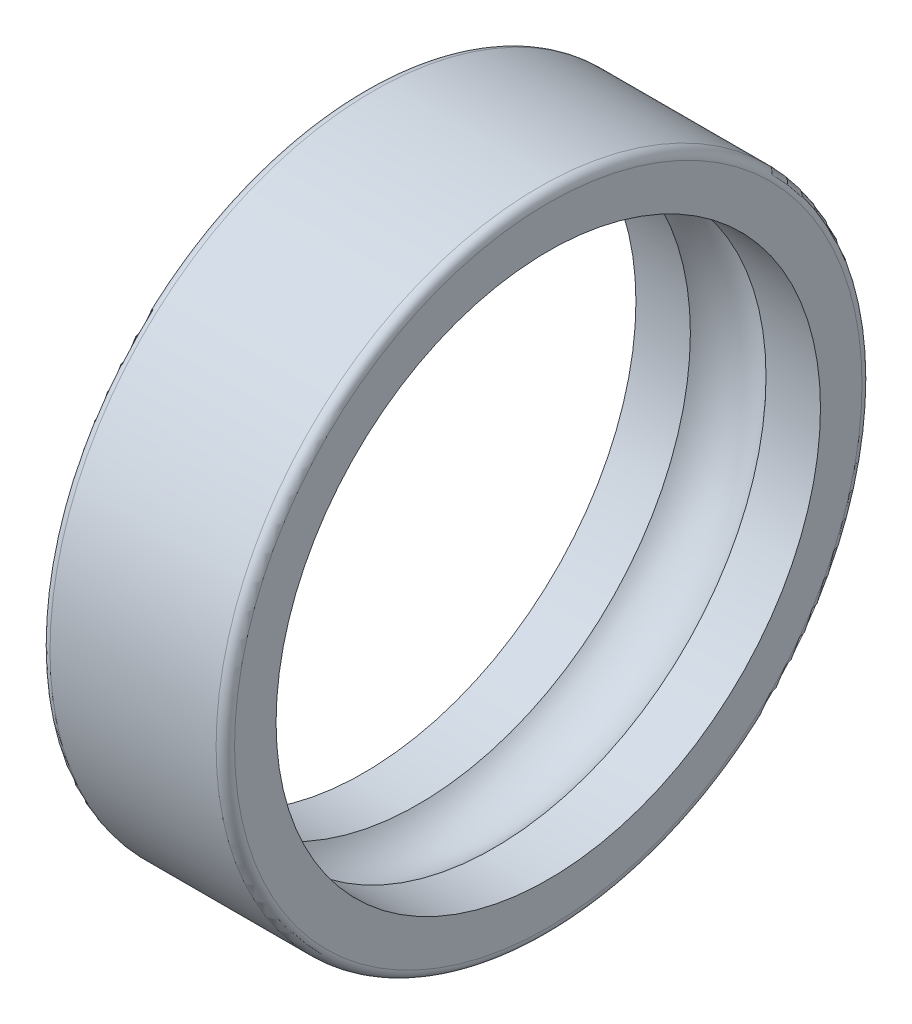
ISO-10303-21;
HEADER;
FILE_DESCRIPTION(('STEP AP214'),'2;1');
FILE_NAME('part.step','',(''),(''),'','','');
FILE_SCHEMA(('AUTOMOTIVE_DESIGN { 1 0 10303 214 1 1 1 1 }'));
ENDSEC;
DATA;
#1=APPLICATION_CONTEXT('core data for automotive mechanical design processes');
#2=APPLICATION_PROTOCOL_DEFINITION('international standard','automotive_design',2000,#1);
#3=PRODUCT_CONTEXT('',#1,'mechanical');
#4=PRODUCT('Part','Part','',(#3));
#5=PRODUCT_RELATED_PRODUCT_CATEGORY('part','',(#4));
#6=PRODUCT_DEFINITION_FORMATION('','',#4);
#7=PRODUCT_DEFINITION_CONTEXT('part definition',#1,'design');
#8=PRODUCT_DEFINITION('design','',#6,#7);
#9=PRODUCT_DEFINITION_SHAPE('','',#8);
#10=(LENGTH_UNIT() NAMED_UNIT(*) SI_UNIT(.MILLI.,.METRE.));
#11=(NAMED_UNIT(*) PLANE_ANGLE_UNIT() SI_UNIT($,.RADIAN.));
#12=(NAMED_UNIT(*) SI_UNIT($,.STERADIAN.) SOLID_ANGLE_UNIT());
#13=UNCERTAINTY_MEASURE_WITH_UNIT(LENGTH_MEASURE(1.E-05),#10,'distance_accuracy_value','');
#14=(GEOMETRIC_REPRESENTATION_CONTEXT(3) GLOBAL_UNCERTAINTY_ASSIGNED_CONTEXT((#13)) GLOBAL_UNIT_ASSIGNED_CONTEXT((#10,
#11,#12)) REPRESENTATION_CONTEXT('',''));
#15=CARTESIAN_POINT('',(0.,0.,0.));
#16=DIRECTION('',(0.,0.,1.));
#17=DIRECTION('',(1.,0.,0.));
#18=AXIS2_PLACEMENT_3D('',#15,#16,#17);
#19=CARTESIAN_POINT('',(0.6,0.,0.));
#20=DIRECTION('',(-1.,0.,0.));
#21=DIRECTION('',(0.,0.,1.));
#22=AXIS2_PLACEMENT_3D('',#19,#20,#21);
#23=TOROIDAL_SURFACE('',#22,20.4,0.600000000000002);
#24=CARTESIAN_POINT('',(0.,0.,0.));
#25=DIRECTION('',(-1.,0.,0.));
#26=DIRECTION('',(0.,0.,1.));
#27=AXIS2_PLACEMENT_3D('',#24,#25,#26);
#28=CIRCLE('',#27,20.4);
#29=CARTESIAN_POINT('',(0.,0.,20.4));
#30=VERTEX_POINT('',#29);
#31=EDGE_CURVE('E10',#30,#30,#28,.T.);
#32=ORIENTED_EDGE('',*,*,#31,.F.);
#33=EDGE_LOOP('',(#32));
#34=FACE_BOUND('',#33,.T.);
#35=CARTESIAN_POINT('',(0.6,0.,0.));
#36=DIRECTION('',(-1.,0.,0.));
#37=DIRECTION('',(0.,0.,1.));
#38=AXIS2_PLACEMENT_3D('',#35,#36,#37);
#39=CIRCLE('',#38,21.);
#40=CARTESIAN_POINT('',(0.6,0.,21.));
#41=VERTEX_POINT('',#40);
#42=EDGE_CURVE('E57',#41,#41,#39,.T.);
#43=ORIENTED_EDGE('',*,*,#42,.T.);
#44=EDGE_LOOP('',(#43));
#45=FACE_BOUND('',#44,.T.);
#46=ADVANCED_FACE('F29',(#34,#45),#23,.T.);
#47=CARTESIAN_POINT('',(0.,0.,-20.4));
#48=DIRECTION('',(1.,0.,0.));
#49=DIRECTION('',(0.,0.,-1.));
#50=AXIS2_PLACEMENT_3D('',#47,#48,#49);
#51=PLANE('',#50);
#52=CARTESIAN_POINT('',(0.,0.,0.));
#53=DIRECTION('',(-1.,0.,0.));
#54=DIRECTION('',(0.,0.,1.));
#55=AXIS2_PLACEMENT_3D('',#52,#53,#54);
#56=CIRCLE('',#55,17.7);
#57=CARTESIAN_POINT('',(0.,0.,17.7));
#58=VERTEX_POINT('',#57);
#59=EDGE_CURVE('E35',#58,#58,#56,.T.);
#60=ORIENTED_EDGE('',*,*,#59,.F.);
#61=EDGE_LOOP('',(#60));
#62=FACE_BOUND('',#61,.T.);
#63=ORIENTED_EDGE('',*,*,#31,.T.);
#64=EDGE_LOOP('',(#63));
#65=FACE_BOUND('',#64,.T.);
#66=ADVANCED_FACE('F94',(#62,#65),#51,.F.);
#67=CARTESIAN_POINT('',(0.,0.,0.));
#68=DIRECTION('',(-1.,0.,0.));
#69=DIRECTION('',(0.,0.,1.));
#70=AXIS2_PLACEMENT_3D('',#67,#68,#69);
#71=CYLINDRICAL_SURFACE('',#70,17.7);
#72=CARTESIAN_POINT('',(3.54032522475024,0.,0.));
#73=DIRECTION('',(-1.,0.,0.));
#74=DIRECTION('',(0.,0.,1.));
#75=AXIS2_PLACEMENT_3D('',#72,#73,#74);
#76=CIRCLE('',#75,17.7);
#77=CARTESIAN_POINT('',(3.54032522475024,0.,17.7));
#78=VERTEX_POINT('',#77);
#79=EDGE_CURVE('E39',#78,#78,#76,.T.);
#80=ORIENTED_EDGE('',*,*,#79,.F.);
#81=EDGE_LOOP('',(#80));
#82=FACE_BOUND('',#81,.T.);
#83=ORIENTED_EDGE('',*,*,#59,.T.);
#84=EDGE_LOOP('',(#83));
#85=FACE_BOUND('',#84,.T.);
#86=ADVANCED_FACE('F89',(#82,#85),#71,.F.);
#87=CARTESIAN_POINT('',(6.,0.,0.));
#88=DIRECTION('',(-1.,0.,0.));
#89=DIRECTION('',(0.,0.,1.));
#90=AXIS2_PLACEMENT_3D('',#87,#88,#89);
#91=TOROIDAL_SURFACE('',#90,15.5,3.3);
#92=CARTESIAN_POINT('',(8.45967477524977,0.,0.));
#93=DIRECTION('',(-1.,0.,0.));
#94=DIRECTION('',(0.,0.,1.));
#95=AXIS2_PLACEMENT_3D('',#92,#93,#94);
#96=CIRCLE('',#95,17.7);
#97=CARTESIAN_POINT('',(8.45967477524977,0.,17.7));
#98=VERTEX_POINT('',#97);
#99=EDGE_CURVE('E43',#98,#98,#96,.T.);
#100=ORIENTED_EDGE('',*,*,#99,.F.);
#101=EDGE_LOOP('',(#100));
#102=FACE_BOUND('',#101,.T.);
#103=ORIENTED_EDGE('',*,*,#79,.T.);
#104=EDGE_LOOP('',(#103));
#105=FACE_BOUND('',#104,.T.);
#106=ADVANCED_FACE('F83',(#102,#105),#91,.F.);
#107=CARTESIAN_POINT('',(0.,0.,0.));
#108=DIRECTION('',(-1.,0.,0.));
#109=DIRECTION('',(0.,0.,1.));
#110=AXIS2_PLACEMENT_3D('',#107,#108,#109);
#111=CYLINDRICAL_SURFACE('',#110,17.7);
#112=CARTESIAN_POINT('',(12.,0.,0.));
#113=DIRECTION('',(-1.,0.,0.));
#114=DIRECTION('',(0.,0.,1.));
#115=AXIS2_PLACEMENT_3D('',#112,#113,#114);
#116=CIRCLE('',#115,17.7);
#117=CARTESIAN_POINT('',(12.,0.,17.7));
#118=VERTEX_POINT('',#117);
#119=EDGE_CURVE('E48',#118,#118,#116,.T.);
#120=ORIENTED_EDGE('',*,*,#119,.F.);
#121=EDGE_LOOP('',(#120));
#122=FACE_BOUND('',#121,.T.);
#123=ORIENTED_EDGE('',*,*,#99,.T.);
#124=EDGE_LOOP('',(#123));
#125=FACE_BOUND('',#124,.T.);
#126=ADVANCED_FACE('F77',(#122,#125),#111,.F.);
#127=CARTESIAN_POINT('',(12.,0.,-20.4));
#128=DIRECTION('',(-1.,0.,0.));
#129=DIRECTION('',(0.,0.,1.));
#130=AXIS2_PLACEMENT_3D('',#127,#128,#129);
#131=PLANE('',#130);
#132=CARTESIAN_POINT('',(12.,0.,0.));
#133=DIRECTION('',(-1.,0.,0.));
#134=DIRECTION('',(0.,0.,1.));
#135=AXIS2_PLACEMENT_3D('',#132,#133,#134);
#136=CIRCLE('',#135,20.4);
#137=CARTESIAN_POINT('',(12.,0.,20.4));
#138=VERTEX_POINT('',#137);
#139=EDGE_CURVE('E51',#138,#138,#136,.T.);
#140=ORIENTED_EDGE('',*,*,#139,.F.);
#141=EDGE_LOOP('',(#140));
#142=FACE_BOUND('',#141,.T.);
#143=ORIENTED_EDGE('',*,*,#119,.T.);
#144=EDGE_LOOP('',(#143));
#145=FACE_BOUND('',#144,.T.);
#146=ADVANCED_FACE('F71',(#142,#145),#131,.F.);
#147=CARTESIAN_POINT('',(11.4,0.,0.));
#148=DIRECTION('',(-1.,0.,0.));
#149=DIRECTION('',(0.,0.,1.));
#150=AXIS2_PLACEMENT_3D('',#147,#148,#149);
#151=TOROIDAL_SURFACE('',#150,20.4,0.600000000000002);
#152=CARTESIAN_POINT('',(11.4,0.,0.));
#153=DIRECTION('',(-1.,0.,0.));
#154=DIRECTION('',(0.,0.,1.));
#155=AXIS2_PLACEMENT_3D('',#152,#153,#154);
#156=CIRCLE('',#155,21.);
#157=CARTESIAN_POINT('',(11.4,0.,21.));
#158=VERTEX_POINT('',#157);
#159=EDGE_CURVE('E54',#158,#158,#156,.T.);
#160=ORIENTED_EDGE('',*,*,#159,.F.);
#161=EDGE_LOOP('',(#160));
#162=FACE_BOUND('',#161,.T.);
#163=ORIENTED_EDGE('',*,*,#139,.T.);
#164=EDGE_LOOP('',(#163));
#165=FACE_BOUND('',#164,.T.);
#166=ADVANCED_FACE('F65',(#162,#165),#151,.T.);
#167=CARTESIAN_POINT('',(0.,0.,0.));
#168=DIRECTION('',(-1.,0.,0.));
#169=DIRECTION('',(0.,0.,1.));
#170=AXIS2_PLACEMENT_3D('',#167,#168,#169);
#171=CYLINDRICAL_SURFACE('',#170,21.);
#172=ORIENTED_EDGE('',*,*,#42,.F.);
#173=EDGE_LOOP('',(#172));
#174=FACE_BOUND('',#173,.T.);
#175=ORIENTED_EDGE('',*,*,#159,.T.);
#176=EDGE_LOOP('',(#175));
#177=FACE_BOUND('',#176,.T.);
#178=ADVANCED_FACE('F62',(#174,#177),#171,.T.);
#179=CLOSED_SHELL('',(#46,#66,#86,#106,#126,#146,#166,#178));
#180=MANIFOLD_SOLID_BREP('B2',#179);
#181=ADVANCED_BREP_SHAPE_REPRESENTATION('',(#18,#180),#14);
#182=SHAPE_DEFINITION_REPRESENTATION(#9,#181);
ENDSEC;
END-ISO-10303-21;
